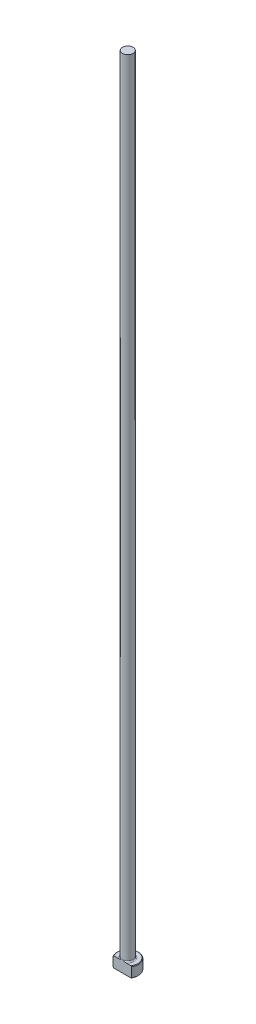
from build123d import *

# Parameters (mm, degrees)
CHAMFER1_SIZE = 0.254
FILLET1_R     = 0.508
KEY_DEPTH     = 356.663777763


with BuildPart() as part:
    # Sketch1 → Revolve1 (revolve)
    with BuildSketch(Plane.XY, mode=Mode.PRIVATE) as revolve1_sk:
        Polygon((0, 0), (-4.7625, 0), (-4.7625, 4.7498), (-2.38125, 4.7498), (-2.38125, 355.6), (0, 355.6), align=None)
    revolve(revolve1_sk.sketch.rotate(Axis((0, 259.958771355, 0), (0, -1, 0)), 270), axis=Axis((0, 259.958771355, 0), (0, -1, 0)))

    # Chamfer1
    chamfer1_edges = [part.edges().sort_by_distance(p)[0] for p in [
        (0, 4.7498, -4.7625),
        (0, 0, -4.7625),
    ]]
    chamfer(chamfer1_edges, length=CHAMFER1_SIZE)

    # Fillet1
    fillet1_edges = [part.edges().sort_by_distance(p)[0] for p in [
        (0, 4.7498, -2.38125),
    ]]
    fillet(fillet1_edges, radius=FILLET1_R)

    # Sketch2 → Key (cut, through all)
    with BuildSketch(Plane(origin=(0, 0, 0), x_dir=(1, 0, 0), z_dir=(0, 1, 0))):
        with BuildLine():
            Line((-4.124445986, -2.38125), (4.124445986, -2.38125))
            ThreePointArc((4.124445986, -2.38125), (0, -4.7625), (-4.124445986, -2.38125))
        make_face()
    extrude(amount=KEY_DEPTH, mode=Mode.SUBTRACT)


solid = part.part
